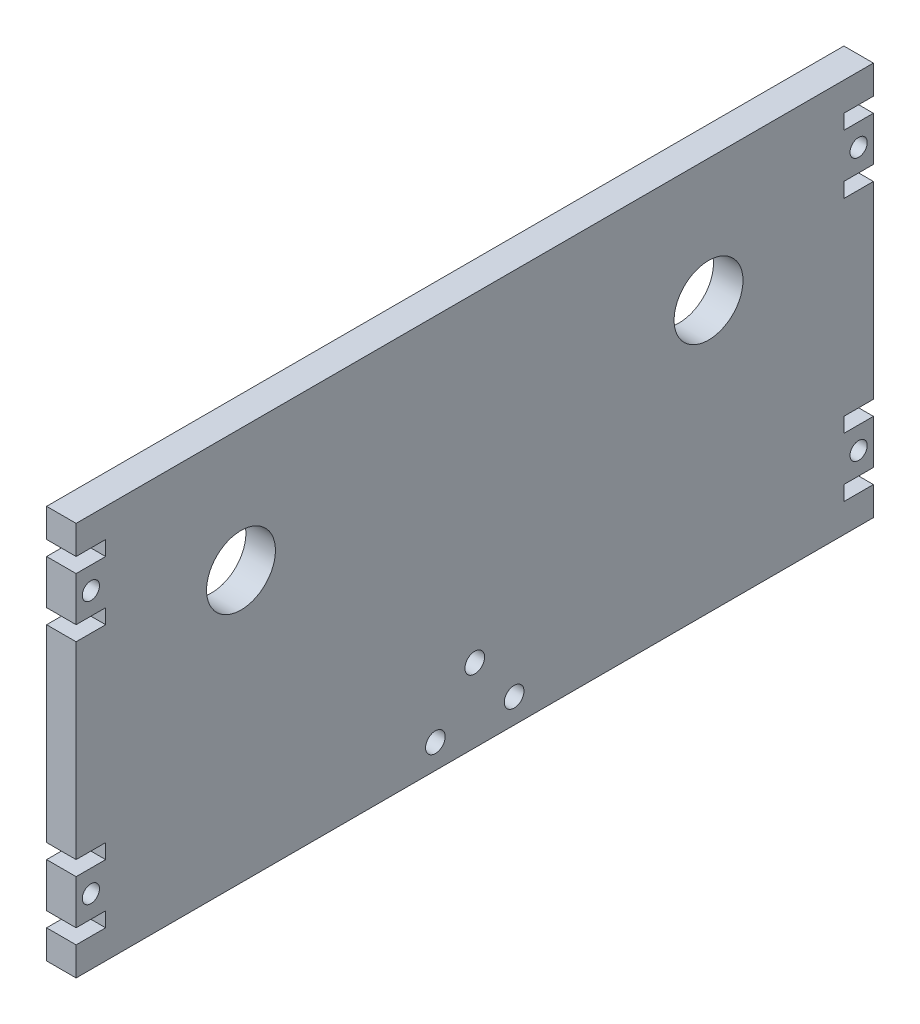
ISO-10303-21;
HEADER;
FILE_DESCRIPTION(('STEP AP214'),'2;1');
FILE_NAME('part.step','',(''),(''),'','','');
FILE_SCHEMA(('AUTOMOTIVE_DESIGN { 1 0 10303 214 1 1 1 1 }'));
ENDSEC;
DATA;
#1=APPLICATION_CONTEXT('core data for automotive mechanical design processes');
#2=APPLICATION_PROTOCOL_DEFINITION('international standard','automotive_design',2000,#1);
#3=PRODUCT_CONTEXT('',#1,'mechanical');
#4=PRODUCT('Part','Part','',(#3));
#5=PRODUCT_RELATED_PRODUCT_CATEGORY('part','',(#4));
#6=PRODUCT_DEFINITION_FORMATION('','',#4);
#7=PRODUCT_DEFINITION_CONTEXT('part definition',#1,'design');
#8=PRODUCT_DEFINITION('design','',#6,#7);
#9=PRODUCT_DEFINITION_SHAPE('','',#8);
#10=(LENGTH_UNIT() NAMED_UNIT(*) SI_UNIT(.MILLI.,.METRE.));
#11=(NAMED_UNIT(*) PLANE_ANGLE_UNIT() SI_UNIT($,.RADIAN.));
#12=(NAMED_UNIT(*) SI_UNIT($,.STERADIAN.) SOLID_ANGLE_UNIT());
#13=UNCERTAINTY_MEASURE_WITH_UNIT(LENGTH_MEASURE(1.E-05),#10,'distance_accuracy_value','');
#14=(GEOMETRIC_REPRESENTATION_CONTEXT(3) GLOBAL_UNCERTAINTY_ASSIGNED_CONTEXT((#13)) GLOBAL_UNIT_ASSIGNED_CONTEXT((#10,
#11,#12)) REPRESENTATION_CONTEXT('',''));
#15=CARTESIAN_POINT('',(0.,0.,0.));
#16=DIRECTION('',(0.,0.,1.));
#17=DIRECTION('',(1.,0.,0.));
#18=AXIS2_PLACEMENT_3D('',#15,#16,#17);
#19=CARTESIAN_POINT('',(3.,-40.,81.));
#20=DIRECTION('',(0.,0.,-1.));
#21=DIRECTION('',(-1.,0.,0.));
#22=AXIS2_PLACEMENT_3D('',#19,#20,#21);
#23=PLANE('',#22);
#24=DIRECTION('',(0.,-1.,0.));
#25=VECTOR('',#24,1.);
#26=CARTESIAN_POINT('',(-3.,-40.,81.));
#27=LINE('',#26,#25);
#28=CARTESIAN_POINT('',(-3.,-22.1666666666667,81.));
#29=VERTEX_POINT('',#28);
#30=CARTESIAN_POINT('',(-3.,-31.1666666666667,81.));
#31=VERTEX_POINT('',#30);
#32=EDGE_CURVE('E467',#29,#31,#27,.T.);
#33=ORIENTED_EDGE('',*,*,#32,.T.);
#34=DIRECTION('',(1.,0.,0.));
#35=VECTOR('',#34,1.);
#36=CARTESIAN_POINT('',(-3.,-31.1666666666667,81.));
#37=LINE('',#36,#35);
#38=CARTESIAN_POINT('',(3.,-31.1666666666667,81.));
#39=VERTEX_POINT('',#38);
#40=EDGE_CURVE('E506',#31,#39,#37,.T.);
#41=ORIENTED_EDGE('',*,*,#40,.T.);
#42=DIRECTION('',(0.,-1.,0.));
#43=VECTOR('',#42,1.);
#44=CARTESIAN_POINT('',(3.,-40.,81.));
#45=LINE('',#44,#43);
#46=CARTESIAN_POINT('',(3.,-22.1666666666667,81.));
#47=VERTEX_POINT('',#46);
#48=EDGE_CURVE('E652',#47,#39,#45,.T.);
#49=ORIENTED_EDGE('',*,*,#48,.F.);
#50=DIRECTION('',(1.,0.,0.));
#51=VECTOR('',#50,1.);
#52=CARTESIAN_POINT('',(-3.,-22.1666666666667,81.));
#53=LINE('',#52,#51);
#54=EDGE_CURVE('E512',#29,#47,#53,.T.);
#55=ORIENTED_EDGE('',*,*,#54,.F.);
#56=EDGE_LOOP('',(#33,#41,#49,#55));
#57=FACE_BOUND('',#56,.T.);
#58=ADVANCED_FACE('F36',(#57),#23,.F.);
#59=CARTESIAN_POINT('',(-3.,19.1666666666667,81.));
#60=VERTEX_POINT('',#59);
#61=CARTESIAN_POINT('',(-3.,-19.1666666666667,81.));
#62=VERTEX_POINT('',#61);
#63=EDGE_CURVE('E466',#60,#62,#27,.T.);
#64=ORIENTED_EDGE('',*,*,#63,.T.);
#65=DIRECTION('',(1.,0.,0.));
#66=VECTOR('',#65,1.);
#67=CARTESIAN_POINT('',(-3.,-19.1666666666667,81.));
#68=LINE('',#67,#66);
#69=CARTESIAN_POINT('',(3.,-19.1666666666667,81.));
#70=VERTEX_POINT('',#69);
#71=EDGE_CURVE('E483',#62,#70,#68,.T.);
#72=ORIENTED_EDGE('',*,*,#71,.T.);
#73=CARTESIAN_POINT('',(3.,19.1666666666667,81.));
#74=VERTEX_POINT('',#73);
#75=EDGE_CURVE('E651',#74,#70,#45,.T.);
#76=ORIENTED_EDGE('',*,*,#75,.F.);
#77=DIRECTION('',(1.,0.,0.));
#78=VECTOR('',#77,1.);
#79=CARTESIAN_POINT('',(-3.,19.1666666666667,81.));
#80=LINE('',#79,#78);
#81=EDGE_CURVE('E397',#60,#74,#80,.T.);
#82=ORIENTED_EDGE('',*,*,#81,.F.);
#83=EDGE_LOOP('',(#64,#72,#76,#82));
#84=FACE_BOUND('',#83,.T.);
#85=ADVANCED_FACE('F481',(#84),#23,.F.);
#86=CARTESIAN_POINT('',(-3.,31.1666666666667,81.));
#87=VERTEX_POINT('',#86);
#88=CARTESIAN_POINT('',(-3.,22.1666666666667,81.));
#89=VERTEX_POINT('',#88);
#90=EDGE_CURVE('E462',#87,#89,#27,.T.);
#91=ORIENTED_EDGE('',*,*,#90,.T.);
#92=DIRECTION('',(1.,0.,0.));
#93=VECTOR('',#92,1.);
#94=CARTESIAN_POINT('',(-3.,22.1666666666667,81.));
#95=LINE('',#94,#93);
#96=CARTESIAN_POINT('',(3.,22.1666666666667,81.));
#97=VERTEX_POINT('',#96);
#98=EDGE_CURVE('E376',#89,#97,#95,.T.);
#99=ORIENTED_EDGE('',*,*,#98,.T.);
#100=CARTESIAN_POINT('',(3.,31.1666666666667,81.));
#101=VERTEX_POINT('',#100);
#102=EDGE_CURVE('E455',#101,#97,#45,.T.);
#103=ORIENTED_EDGE('',*,*,#102,.F.);
#104=DIRECTION('',(1.,0.,0.));
#105=VECTOR('',#104,1.);
#106=CARTESIAN_POINT('',(-3.,31.1666666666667,81.));
#107=LINE('',#106,#105);
#108=EDGE_CURVE('E371',#87,#101,#107,.T.);
#109=ORIENTED_EDGE('',*,*,#108,.F.);
#110=EDGE_LOOP('',(#91,#99,#103,#109));
#111=FACE_BOUND('',#110,.T.);
#112=ADVANCED_FACE('F614',(#111),#23,.F.);
#113=CARTESIAN_POINT('',(-3.,40.,81.));
#114=VERTEX_POINT('',#113);
#115=CARTESIAN_POINT('',(-3.,34.1666666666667,81.));
#116=VERTEX_POINT('',#115);
#117=EDGE_CURVE('E460',#114,#116,#27,.T.);
#118=ORIENTED_EDGE('',*,*,#117,.T.);
#119=DIRECTION('',(1.,0.,0.));
#120=VECTOR('',#119,1.);
#121=CARTESIAN_POINT('',(-3.,34.1666666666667,81.));
#122=LINE('',#121,#120);
#123=CARTESIAN_POINT('',(3.,34.1666666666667,81.));
#124=VERTEX_POINT('',#123);
#125=EDGE_CURVE('E351',#116,#124,#122,.T.);
#126=ORIENTED_EDGE('',*,*,#125,.T.);
#127=CARTESIAN_POINT('',(3.,40.,81.));
#128=VERTEX_POINT('',#127);
#129=EDGE_CURVE('E451',#128,#124,#45,.T.);
#130=ORIENTED_EDGE('',*,*,#129,.F.);
#131=DIRECTION('',(-1.,0.,0.));
#132=VECTOR('',#131,1.);
#133=CARTESIAN_POINT('',(3.,40.,81.));
#134=LINE('',#133,#132);
#135=EDGE_CURVE('E310',#128,#114,#134,.T.);
#136=ORIENTED_EDGE('',*,*,#135,.T.);
#137=EDGE_LOOP('',(#118,#126,#130,#136));
#138=FACE_BOUND('',#137,.T.);
#139=ADVANCED_FACE('F618',(#138),#23,.F.);
#140=CARTESIAN_POINT('',(3.,-40.,-81.));
#141=DIRECTION('',(0.,0.,1.));
#142=DIRECTION('',(1.,0.,0.));
#143=AXIS2_PLACEMENT_3D('',#140,#141,#142);
#144=PLANE('',#143);
#145=DIRECTION('',(0.,1.,0.));
#146=VECTOR('',#145,1.);
#147=CARTESIAN_POINT('',(-3.,-40.,-81.));
#148=LINE('',#147,#146);
#149=CARTESIAN_POINT('',(-3.,-31.1666666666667,-81.));
#150=VERTEX_POINT('',#149);
#151=CARTESIAN_POINT('',(-3.,-22.1666666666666,-81.));
#152=VERTEX_POINT('',#151);
#153=EDGE_CURVE('E295',#150,#152,#148,.T.);
#154=ORIENTED_EDGE('',*,*,#153,.T.);
#155=DIRECTION('',(1.,0.,0.));
#156=VECTOR('',#155,1.);
#157=CARTESIAN_POINT('',(-3.,-22.1666666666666,-81.));
#158=LINE('',#157,#156);
#159=CARTESIAN_POINT('',(3.,-22.1666666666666,-81.));
#160=VERTEX_POINT('',#159);
#161=EDGE_CURVE('E543',#152,#160,#158,.T.);
#162=ORIENTED_EDGE('',*,*,#161,.T.);
#163=DIRECTION('',(0.,1.,0.));
#164=VECTOR('',#163,1.);
#165=CARTESIAN_POINT('',(3.,-40.,-81.));
#166=LINE('',#165,#164);
#167=CARTESIAN_POINT('',(3.,-31.1666666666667,-81.));
#168=VERTEX_POINT('',#167);
#169=EDGE_CURVE('E459',#168,#160,#166,.T.);
#170=ORIENTED_EDGE('',*,*,#169,.F.);
#171=DIRECTION('',(1.,0.,0.));
#172=VECTOR('',#171,1.);
#173=CARTESIAN_POINT('',(-3.,-31.1666666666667,-81.));
#174=LINE('',#173,#172);
#175=EDGE_CURVE('E358',#150,#168,#174,.T.);
#176=ORIENTED_EDGE('',*,*,#175,.F.);
#177=EDGE_LOOP('',(#154,#162,#170,#176));
#178=FACE_BOUND('',#177,.T.);
#179=ADVANCED_FACE('F628',(#178),#144,.F.);
#180=CARTESIAN_POINT('',(-3.,-40.,-81.));
#181=VERTEX_POINT('',#180);
#182=CARTESIAN_POINT('',(-3.,-34.1666666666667,-81.));
#183=VERTEX_POINT('',#182);
#184=EDGE_CURVE('E299',#181,#183,#148,.T.);
#185=ORIENTED_EDGE('',*,*,#184,.T.);
#186=DIRECTION('',(1.,0.,0.));
#187=VECTOR('',#186,1.);
#188=CARTESIAN_POINT('',(-3.,-34.1666666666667,-81.));
#189=LINE('',#188,#187);
#190=CARTESIAN_POINT('',(3.,-34.1666666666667,-81.));
#191=VERTEX_POINT('',#190);
#192=EDGE_CURVE('E348',#183,#191,#189,.T.);
#193=ORIENTED_EDGE('',*,*,#192,.T.);
#194=CARTESIAN_POINT('',(3.,-40.,-81.));
#195=VERTEX_POINT('',#194);
#196=EDGE_CURVE('E324',#195,#191,#166,.T.);
#197=ORIENTED_EDGE('',*,*,#196,.F.);
#198=DIRECTION('',(-1.,0.,0.));
#199=VECTOR('',#198,1.);
#200=CARTESIAN_POINT('',(3.,-40.,-81.));
#201=LINE('',#200,#199);
#202=EDGE_CURVE('E44',#195,#181,#201,.T.);
#203=ORIENTED_EDGE('',*,*,#202,.T.);
#204=EDGE_LOOP('',(#185,#193,#197,#203));
#205=FACE_BOUND('',#204,.T.);
#206=ADVANCED_FACE('F321',(#205),#144,.F.);
#207=CARTESIAN_POINT('',(3.,-19.1666666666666,-81.));
#208=VERTEX_POINT('',#207);
#209=CARTESIAN_POINT('',(3.,19.1666666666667,-81.));
#210=VERTEX_POINT('',#209);
#211=EDGE_CURVE('E1066',#208,#210,#166,.T.);
#212=ORIENTED_EDGE('',*,*,#211,.F.);
#213=DIRECTION('',(1.,0.,0.));
#214=VECTOR('',#213,1.);
#215=CARTESIAN_POINT('',(-3.,-19.1666666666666,-81.));
#216=LINE('',#215,#214);
#217=CARTESIAN_POINT('',(-3.,-19.1666666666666,-81.));
#218=VERTEX_POINT('',#217);
#219=EDGE_CURVE('E294',#218,#208,#216,.T.);
#220=ORIENTED_EDGE('',*,*,#219,.F.);
#221=CARTESIAN_POINT('',(-3.,19.1666666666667,-81.));
#222=VERTEX_POINT('',#221);
#223=EDGE_CURVE('E287',#218,#222,#148,.T.);
#224=ORIENTED_EDGE('',*,*,#223,.T.);
#225=DIRECTION('',(1.,0.,0.));
#226=VECTOR('',#225,1.);
#227=CARTESIAN_POINT('',(-3.,19.1666666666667,-81.));
#228=LINE('',#227,#226);
#229=EDGE_CURVE('E269',#222,#210,#228,.T.);
#230=ORIENTED_EDGE('',*,*,#229,.T.);
#231=EDGE_LOOP('',(#212,#220,#224,#230));
#232=FACE_BOUND('',#231,.T.);
#233=ADVANCED_FACE('F293',(#232),#144,.F.);
#234=CARTESIAN_POINT('',(3.,22.1666666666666,-81.));
#235=VERTEX_POINT('',#234);
#236=CARTESIAN_POINT('',(3.,31.1666666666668,-81.));
#237=VERTEX_POINT('',#236);
#238=EDGE_CURVE('E1064',#235,#237,#166,.T.);
#239=ORIENTED_EDGE('',*,*,#238,.F.);
#240=DIRECTION('',(1.,0.,0.));
#241=VECTOR('',#240,1.);
#242=CARTESIAN_POINT('',(-3.,22.1666666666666,-81.));
#243=LINE('',#242,#241);
#244=CARTESIAN_POINT('',(-3.,22.1666666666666,-81.));
#245=VERTEX_POINT('',#244);
#246=EDGE_CURVE('E280',#245,#235,#243,.T.);
#247=ORIENTED_EDGE('',*,*,#246,.F.);
#248=CARTESIAN_POINT('',(-3.,31.1666666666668,-81.));
#249=VERTEX_POINT('',#248);
#250=EDGE_CURVE('E296',#245,#249,#148,.T.);
#251=ORIENTED_EDGE('',*,*,#250,.T.);
#252=DIRECTION('',(1.,0.,0.));
#253=VECTOR('',#252,1.);
#254=CARTESIAN_POINT('',(-3.,31.1666666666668,-81.));
#255=LINE('',#254,#253);
#256=EDGE_CURVE('E1099',#249,#237,#255,.T.);
#257=ORIENTED_EDGE('',*,*,#256,.T.);
#258=EDGE_LOOP('',(#239,#247,#251,#257));
#259=FACE_BOUND('',#258,.T.);
#260=ADVANCED_FACE('F617',(#259),#144,.F.);
#261=CARTESIAN_POINT('',(3.,-34.1666666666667,81.));
#262=VERTEX_POINT('',#261);
#263=CARTESIAN_POINT('',(3.,-40.,81.));
#264=VERTEX_POINT('',#263);
#265=EDGE_CURVE('E309',#262,#264,#45,.T.);
#266=ORIENTED_EDGE('',*,*,#265,.F.);
#267=DIRECTION('',(1.,0.,0.));
#268=VECTOR('',#267,1.);
#269=CARTESIAN_POINT('',(-3.,-34.1666666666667,81.));
#270=LINE('',#269,#268);
#271=CARTESIAN_POINT('',(-3.,-34.1666666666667,81.));
#272=VERTEX_POINT('',#271);
#273=EDGE_CURVE('E523',#272,#262,#270,.T.);
#274=ORIENTED_EDGE('',*,*,#273,.F.);
#275=CARTESIAN_POINT('',(-3.,-40.,81.));
#276=VERTEX_POINT('',#275);
#277=EDGE_CURVE('E442',#272,#276,#27,.T.);
#278=ORIENTED_EDGE('',*,*,#277,.T.);
#279=DIRECTION('',(-1.,0.,0.));
#280=VECTOR('',#279,1.);
#281=CARTESIAN_POINT('',(3.,-40.,81.));
#282=LINE('',#281,#280);
#283=EDGE_CURVE('E11',#264,#276,#282,.T.);
#284=ORIENTED_EDGE('',*,*,#283,.F.);
#285=EDGE_LOOP('',(#266,#274,#278,#284));
#286=FACE_BOUND('',#285,.T.);
#287=ADVANCED_FACE('F38',(#286),#23,.F.);
#288=CARTESIAN_POINT('',(3.,-40.,-81.));
#289=DIRECTION('',(0.,1.,0.));
#290=DIRECTION('',(0.,0.,1.));
#291=AXIS2_PLACEMENT_3D('',#288,#289,#290);
#292=PLANE('',#291);
#293=DIRECTION('',(0.,0.,-1.));
#294=VECTOR('',#293,1.);
#295=CARTESIAN_POINT('',(-3.,-40.,-81.));
#296=LINE('',#295,#294);
#297=EDGE_CURVE('E306',#276,#181,#296,.T.);
#298=ORIENTED_EDGE('',*,*,#297,.T.);
#299=ORIENTED_EDGE('',*,*,#202,.F.);
#300=DIRECTION('',(0.,0.,-1.));
#301=VECTOR('',#300,1.);
#302=CARTESIAN_POINT('',(3.,-40.,-81.));
#303=LINE('',#302,#301);
#304=EDGE_CURVE('E454',#264,#195,#303,.T.);
#305=ORIENTED_EDGE('',*,*,#304,.F.);
#306=ORIENTED_EDGE('',*,*,#283,.T.);
#307=EDGE_LOOP('',(#298,#299,#305,#306));
#308=FACE_BOUND('',#307,.T.);
#309=ADVANCED_FACE('F616',(#308),#292,.F.);
#310=CARTESIAN_POINT('',(3.,34.1666666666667,-81.));
#311=VERTEX_POINT('',#310);
#312=CARTESIAN_POINT('',(3.,40.,-81.));
#313=VERTEX_POINT('',#312);
#314=EDGE_CURVE('E457',#311,#313,#166,.T.);
#315=ORIENTED_EDGE('',*,*,#314,.F.);
#316=DIRECTION('',(1.,0.,0.));
#317=VECTOR('',#316,1.);
#318=CARTESIAN_POINT('',(-3.,34.1666666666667,-81.));
#319=LINE('',#318,#317);
#320=CARTESIAN_POINT('',(-3.,34.1666666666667,-81.));
#321=VERTEX_POINT('',#320);
#322=EDGE_CURVE('E500',#321,#311,#319,.T.);
#323=ORIENTED_EDGE('',*,*,#322,.F.);
#324=CARTESIAN_POINT('',(-3.,40.,-81.));
#325=VERTEX_POINT('',#324);
#326=EDGE_CURVE('E301',#321,#325,#148,.T.);
#327=ORIENTED_EDGE('',*,*,#326,.T.);
#328=DIRECTION('',(-1.,0.,0.));
#329=VECTOR('',#328,1.);
#330=CARTESIAN_POINT('',(3.,40.,-81.));
#331=LINE('',#330,#329);
#332=EDGE_CURVE('E313',#313,#325,#331,.T.);
#333=ORIENTED_EDGE('',*,*,#332,.F.);
#334=EDGE_LOOP('',(#315,#323,#327,#333));
#335=FACE_BOUND('',#334,.T.);
#336=ADVANCED_FACE('F623',(#335),#144,.F.);
#337=CARTESIAN_POINT('',(3.,40.,-81.));
#338=DIRECTION('',(0.,-1.,0.));
#339=DIRECTION('',(0.,0.,-1.));
#340=AXIS2_PLACEMENT_3D('',#337,#338,#339);
#341=PLANE('',#340);
#342=DIRECTION('',(0.,0.,1.));
#343=VECTOR('',#342,1.);
#344=CARTESIAN_POINT('',(-3.,40.,-81.));
#345=LINE('',#344,#343);
#346=EDGE_CURVE('E305',#325,#114,#345,.T.);
#347=ORIENTED_EDGE('',*,*,#346,.T.);
#348=ORIENTED_EDGE('',*,*,#135,.F.);
#349=DIRECTION('',(0.,0.,1.));
#350=VECTOR('',#349,1.);
#351=CARTESIAN_POINT('',(3.,40.,-81.));
#352=LINE('',#351,#350);
#353=EDGE_CURVE('E314',#313,#128,#352,.T.);
#354=ORIENTED_EDGE('',*,*,#353,.F.);
#355=ORIENTED_EDGE('',*,*,#332,.T.);
#356=EDGE_LOOP('',(#347,#348,#354,#355));
#357=FACE_BOUND('',#356,.T.);
#358=ADVANCED_FACE('F576',(#357),#341,.F.);
#359=CARTESIAN_POINT('',(3.,0.,0.));
#360=DIRECTION('',(1.,0.,0.));
#361=DIRECTION('',(0.,0.,-1.));
#362=AXIS2_PLACEMENT_3D('',#359,#360,#361);
#363=PLANE('',#362);
#364=DIRECTION('',(0.,0.,-1.));
#365=VECTOR('',#364,1.);
#366=CARTESIAN_POINT('',(3.,-22.1666666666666,-81.));
#367=LINE('',#366,#365);
#368=CARTESIAN_POINT('',(3.,-22.1666666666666,-75.));
#369=VERTEX_POINT('',#368);
#370=EDGE_CURVE('E546',#369,#160,#367,.T.);
#371=ORIENTED_EDGE('',*,*,#370,.F.);
#372=DIRECTION('',(0.,-1.,0.));
#373=VECTOR('',#372,1.);
#374=CARTESIAN_POINT('',(3.,-19.1666666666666,-75.));
#375=LINE('',#374,#373);
#376=CARTESIAN_POINT('',(3.,-19.1666666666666,-75.));
#377=VERTEX_POINT('',#376);
#378=EDGE_CURVE('E554',#377,#369,#375,.T.);
#379=ORIENTED_EDGE('',*,*,#378,.F.);
#380=DIRECTION('',(0.,0.,1.));
#381=VECTOR('',#380,1.);
#382=CARTESIAN_POINT('',(3.,-19.1666666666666,-81.));
#383=LINE('',#382,#381);
#384=EDGE_CURVE('E551',#208,#377,#383,.T.);
#385=ORIENTED_EDGE('',*,*,#384,.F.);
#386=ORIENTED_EDGE('',*,*,#211,.T.);
#387=DIRECTION('',(0.,0.,-1.));
#388=VECTOR('',#387,1.);
#389=CARTESIAN_POINT('',(3.,19.1666666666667,-81.));
#390=LINE('',#389,#388);
#391=CARTESIAN_POINT('',(3.,19.1666666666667,-75.));
#392=VERTEX_POINT('',#391);
#393=EDGE_CURVE('E275',#392,#210,#390,.T.);
#394=ORIENTED_EDGE('',*,*,#393,.F.);
#395=DIRECTION('',(0.,-1.,0.));
#396=VECTOR('',#395,1.);
#397=CARTESIAN_POINT('',(3.,19.1666666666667,-75.));
#398=LINE('',#397,#396);
#399=CARTESIAN_POINT('',(3.,22.1666666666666,-75.));
#400=VERTEX_POINT('',#399);
#401=EDGE_CURVE('E290',#400,#392,#398,.T.);
#402=ORIENTED_EDGE('',*,*,#401,.F.);
#403=DIRECTION('',(0.,0.,1.));
#404=VECTOR('',#403,1.);
#405=CARTESIAN_POINT('',(3.,22.1666666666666,-81.));
#406=LINE('',#405,#404);
#407=EDGE_CURVE('E1083',#235,#400,#406,.T.);
#408=ORIENTED_EDGE('',*,*,#407,.F.);
#409=ORIENTED_EDGE('',*,*,#238,.T.);
#410=DIRECTION('',(0.,0.,-1.));
#411=VECTOR('',#410,1.);
#412=CARTESIAN_POINT('',(3.,31.1666666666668,-81.));
#413=LINE('',#412,#411);
#414=CARTESIAN_POINT('',(3.,31.1666666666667,-75.));
#415=VERTEX_POINT('',#414);
#416=EDGE_CURVE('E1104',#415,#237,#413,.T.);
#417=ORIENTED_EDGE('',*,*,#416,.F.);
#418=DIRECTION('',(0.,-1.,0.));
#419=VECTOR('',#418,1.);
#420=CARTESIAN_POINT('',(3.,34.1666666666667,-75.));
#421=LINE('',#420,#419);
#422=CARTESIAN_POINT('',(3.,34.1666666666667,-75.));
#423=VERTEX_POINT('',#422);
#424=EDGE_CURVE('E1113',#423,#415,#421,.T.);
#425=ORIENTED_EDGE('',*,*,#424,.F.);
#426=DIRECTION('',(0.,0.,1.));
#427=VECTOR('',#426,1.);
#428=CARTESIAN_POINT('',(3.,34.1666666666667,-81.));
#429=LINE('',#428,#427);
#430=EDGE_CURVE('E1110',#311,#423,#429,.T.);
#431=ORIENTED_EDGE('',*,*,#430,.F.);
#432=ORIENTED_EDGE('',*,*,#314,.T.);
#433=ORIENTED_EDGE('',*,*,#353,.T.);
#434=ORIENTED_EDGE('',*,*,#129,.T.);
#435=DIRECTION('',(0.,0.,1.));
#436=VECTOR('',#435,1.);
#437=CARTESIAN_POINT('',(3.,34.1666666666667,81.));
#438=LINE('',#437,#436);
#439=CARTESIAN_POINT('',(3.,34.1666666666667,75.));
#440=VERTEX_POINT('',#439);
#441=EDGE_CURVE('E365',#440,#124,#438,.T.);
#442=ORIENTED_EDGE('',*,*,#441,.F.);
#443=DIRECTION('',(0.,1.,0.));
#444=VECTOR('',#443,1.);
#445=CARTESIAN_POINT('',(3.,34.1666666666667,75.));
#446=LINE('',#445,#444);
#447=CARTESIAN_POINT('',(3.,31.1666666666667,75.));
#448=VERTEX_POINT('',#447);
#449=EDGE_CURVE('E375',#448,#440,#446,.T.);
#450=ORIENTED_EDGE('',*,*,#449,.F.);
#451=DIRECTION('',(0.,0.,-1.));
#452=VECTOR('',#451,1.);
#453=CARTESIAN_POINT('',(3.,31.1666666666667,81.));
#454=LINE('',#453,#452);
#455=EDGE_CURVE('E372',#101,#448,#454,.T.);
#456=ORIENTED_EDGE('',*,*,#455,.F.);
#457=ORIENTED_EDGE('',*,*,#102,.T.);
#458=DIRECTION('',(0.,0.,1.));
#459=VECTOR('',#458,1.);
#460=CARTESIAN_POINT('',(3.,22.1666666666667,81.));
#461=LINE('',#460,#459);
#462=CARTESIAN_POINT('',(3.,22.1666666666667,75.));
#463=VERTEX_POINT('',#462);
#464=EDGE_CURVE('E391',#463,#97,#461,.T.);
#465=ORIENTED_EDGE('',*,*,#464,.F.);
#466=DIRECTION('',(0.,1.,0.));
#467=VECTOR('',#466,1.);
#468=CARTESIAN_POINT('',(3.,19.1666666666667,75.));
#469=LINE('',#468,#467);
#470=CARTESIAN_POINT('',(3.,19.1666666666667,75.));
#471=VERTEX_POINT('',#470);
#472=EDGE_CURVE('E401',#471,#463,#469,.T.);
#473=ORIENTED_EDGE('',*,*,#472,.F.);
#474=DIRECTION('',(0.,0.,-1.));
#475=VECTOR('',#474,1.);
#476=CARTESIAN_POINT('',(3.,19.1666666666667,81.));
#477=LINE('',#476,#475);
#478=EDGE_CURVE('E398',#74,#471,#477,.T.);
#479=ORIENTED_EDGE('',*,*,#478,.F.);
#480=ORIENTED_EDGE('',*,*,#75,.T.);
#481=DIRECTION('',(0.,0.,1.));
#482=VECTOR('',#481,1.);
#483=CARTESIAN_POINT('',(3.,-19.1666666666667,81.));
#484=LINE('',#483,#482);
#485=CARTESIAN_POINT('',(3.,-19.1666666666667,75.));
#486=VERTEX_POINT('',#485);
#487=EDGE_CURVE('E504',#486,#70,#484,.T.);
#488=ORIENTED_EDGE('',*,*,#487,.F.);
#489=DIRECTION('',(0.,1.,0.));
#490=VECTOR('',#489,1.);
#491=CARTESIAN_POINT('',(3.,-19.1666666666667,75.));
#492=LINE('',#491,#490);
#493=CARTESIAN_POINT('',(3.,-22.1666666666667,75.));
#494=VERTEX_POINT('',#493);
#495=EDGE_CURVE('E493',#494,#486,#492,.T.);
#496=ORIENTED_EDGE('',*,*,#495,.F.);
#497=DIRECTION('',(0.,0.,-1.));
#498=VECTOR('',#497,1.);
#499=CARTESIAN_POINT('',(3.,-22.1666666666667,81.));
#500=LINE('',#499,#498);
#501=EDGE_CURVE('E497',#47,#494,#500,.T.);
#502=ORIENTED_EDGE('',*,*,#501,.F.);
#503=ORIENTED_EDGE('',*,*,#48,.T.);
#504=DIRECTION('',(0.,0.,1.));
#505=VECTOR('',#504,1.);
#506=CARTESIAN_POINT('',(3.,-31.1666666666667,81.));
#507=LINE('',#506,#505);
#508=CARTESIAN_POINT('',(3.,-31.1666666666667,75.));
#509=VERTEX_POINT('',#508);
#510=EDGE_CURVE('E518',#509,#39,#507,.T.);
#511=ORIENTED_EDGE('',*,*,#510,.F.);
#512=DIRECTION('',(0.,1.,0.));
#513=VECTOR('',#512,1.);
#514=CARTESIAN_POINT('',(3.,-34.1666666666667,75.));
#515=LINE('',#514,#513);
#516=CARTESIAN_POINT('',(3.,-34.1666666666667,75.));
#517=VERTEX_POINT('',#516);
#518=EDGE_CURVE('E527',#517,#509,#515,.T.);
#519=ORIENTED_EDGE('',*,*,#518,.F.);
#520=DIRECTION('',(0.,0.,-1.));
#521=VECTOR('',#520,1.);
#522=CARTESIAN_POINT('',(3.,-34.1666666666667,81.));
#523=LINE('',#522,#521);
#524=EDGE_CURVE('E524',#262,#517,#523,.T.);
#525=ORIENTED_EDGE('',*,*,#524,.F.);
#526=ORIENTED_EDGE('',*,*,#265,.T.);
#527=ORIENTED_EDGE('',*,*,#304,.T.);
#528=ORIENTED_EDGE('',*,*,#196,.T.);
#529=DIRECTION('',(0.,0.,-1.));
#530=VECTOR('',#529,1.);
#531=CARTESIAN_POINT('',(3.,-34.1666666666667,-81.));
#532=LINE('',#531,#530);
#533=CARTESIAN_POINT('',(3.,-34.1666666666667,-75.0000000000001));
#534=VERTEX_POINT('',#533);
#535=EDGE_CURVE('E349',#534,#191,#532,.T.);
#536=ORIENTED_EDGE('',*,*,#535,.F.);
#537=DIRECTION('',(0.,-1.,0.));
#538=VECTOR('',#537,1.);
#539=CARTESIAN_POINT('',(3.,-34.1666666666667,-75.0000000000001));
#540=LINE('',#539,#538);
#541=CARTESIAN_POINT('',(3.,-31.1666666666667,-75.0000000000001));
#542=VERTEX_POINT('',#541);
#543=EDGE_CURVE('E337',#542,#534,#540,.T.);
#544=ORIENTED_EDGE('',*,*,#543,.F.);
#545=DIRECTION('',(0.,0.,1.));
#546=VECTOR('',#545,1.);
#547=CARTESIAN_POINT('',(3.,-31.1666666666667,-81.));
#548=LINE('',#547,#546);
#549=EDGE_CURVE('E341',#168,#542,#548,.T.);
#550=ORIENTED_EDGE('',*,*,#549,.F.);
#551=ORIENTED_EDGE('',*,*,#169,.T.);
#552=EDGE_LOOP('',(#371,#379,#385,#386,#394,#402,#408,#409,#417,#425,#431,#432,#433,#434,#442,
#450,#456,#457,#465,#473,#479,#480,#488,#496,#502,#503,#511,#519,#525,#526,#527,#528,#536,#544,
#550,#551));
#553=FACE_BOUND('',#552,.T.);
#554=CARTESIAN_POINT('',(3.,-26.6666666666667,-78.));
#555=DIRECTION('',(1.,0.,0.));
#556=DIRECTION('',(0.,0.,1.));
#557=AXIS2_PLACEMENT_3D('',#554,#555,#556);
#558=CIRCLE('',#557,1.75);
#559=CARTESIAN_POINT('',(3.,-26.6666666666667,-76.25));
#560=VERTEX_POINT('',#559);
#561=EDGE_CURVE('E540',#560,#560,#558,.T.);
#562=ORIENTED_EDGE('',*,*,#561,.F.);
#563=EDGE_LOOP('',(#562));
#564=FACE_BOUND('',#563,.T.);
#565=CARTESIAN_POINT('',(3.,-26.6666666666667,78.));
#566=DIRECTION('',(1.,0.,0.));
#567=DIRECTION('',(0.,0.,-1.));
#568=AXIS2_PLACEMENT_3D('',#565,#566,#567);
#569=CIRCLE('',#568,1.75);
#570=CARTESIAN_POINT('',(3.,-26.6666666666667,76.25));
#571=VERTEX_POINT('',#570);
#572=EDGE_CURVE('E344',#571,#571,#569,.T.);
#573=ORIENTED_EDGE('',*,*,#572,.F.);
#574=EDGE_LOOP('',(#573));
#575=FACE_BOUND('',#574,.T.);
#576=CARTESIAN_POINT('',(3.,26.6666666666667,-78.));
#577=DIRECTION('',(1.,0.,0.));
#578=DIRECTION('',(0.,0.,1.));
#579=AXIS2_PLACEMENT_3D('',#576,#577,#578);
#580=CIRCLE('',#579,1.75);
#581=CARTESIAN_POINT('',(3.,26.6666666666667,-76.25));
#582=VERTEX_POINT('',#581);
#583=EDGE_CURVE('E582',#582,#582,#580,.T.);
#584=ORIENTED_EDGE('',*,*,#583,.F.);
#585=EDGE_LOOP('',(#584));
#586=FACE_BOUND('',#585,.T.);
#587=CARTESIAN_POINT('',(3.,26.6666666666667,78.));
#588=DIRECTION('',(1.,0.,0.));
#589=DIRECTION('',(0.,0.,-1.));
#590=AXIS2_PLACEMENT_3D('',#587,#588,#589);
#591=CIRCLE('',#590,1.75);
#592=CARTESIAN_POINT('',(3.,26.6666666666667,76.25));
#593=VERTEX_POINT('',#592);
#594=EDGE_CURVE('E417',#593,#593,#591,.T.);
#595=ORIENTED_EDGE('',*,*,#594,.F.);
#596=EDGE_LOOP('',(#595));
#597=FACE_BOUND('',#596,.T.);
#598=CARTESIAN_POINT('',(3.,-35.,8.));
#599=DIRECTION('',(1.,0.,0.));
#600=DIRECTION('',(0.,0.,-1.));
#601=AXIS2_PLACEMENT_3D('',#598,#599,#600);
#602=CIRCLE('',#601,2.);
#603=CARTESIAN_POINT('',(3.,-35.,6.));
#604=VERTEX_POINT('',#603);
#605=EDGE_CURVE('E425',#604,#604,#602,.T.);
#606=ORIENTED_EDGE('',*,*,#605,.F.);
#607=EDGE_LOOP('',(#606));
#608=FACE_BOUND('',#607,.T.);
#609=CARTESIAN_POINT('',(3.,-35.,-8.));
#610=DIRECTION('',(1.,0.,0.));
#611=DIRECTION('',(0.,0.,-1.));
#612=AXIS2_PLACEMENT_3D('',#609,#610,#611);
#613=CIRCLE('',#612,2.);
#614=CARTESIAN_POINT('',(3.,-35.,-10.));
#615=VERTEX_POINT('',#614);
#616=EDGE_CURVE('E431',#615,#615,#613,.T.);
#617=ORIENTED_EDGE('',*,*,#616,.F.);
#618=EDGE_LOOP('',(#617));
#619=FACE_BOUND('',#618,.T.);
#620=CARTESIAN_POINT('',(3.,-25.,0.));
#621=DIRECTION('',(1.,0.,0.));
#622=DIRECTION('',(0.,0.,-1.));
#623=AXIS2_PLACEMENT_3D('',#620,#621,#622);
#624=CIRCLE('',#623,2.);
#625=CARTESIAN_POINT('',(3.,-25.,-2.));
#626=VERTEX_POINT('',#625);
#627=EDGE_CURVE('E416',#626,#626,#624,.T.);
#628=ORIENTED_EDGE('',*,*,#627,.F.);
#629=EDGE_LOOP('',(#628));
#630=FACE_BOUND('',#629,.T.);
#631=CARTESIAN_POINT('',(3.,15.,47.5));
#632=DIRECTION('',(1.,0.,0.));
#633=DIRECTION('',(0.,0.,-1.));
#634=AXIS2_PLACEMENT_3D('',#631,#632,#633);
#635=CIRCLE('',#634,7.);
#636=CARTESIAN_POINT('',(3.,15.,40.5));
#637=VERTEX_POINT('',#636);
#638=EDGE_CURVE('E443',#637,#637,#635,.T.);
#639=ORIENTED_EDGE('',*,*,#638,.F.);
#640=EDGE_LOOP('',(#639));
#641=FACE_BOUND('',#640,.T.);
#642=CARTESIAN_POINT('',(3.,15.,-47.5));
#643=DIRECTION('',(1.,0.,0.));
#644=DIRECTION('',(0.,0.,-1.));
#645=AXIS2_PLACEMENT_3D('',#642,#643,#644);
#646=CIRCLE('',#645,6.99999999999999);
#647=CARTESIAN_POINT('',(3.,15.,-54.5));
#648=VERTEX_POINT('',#647);
#649=EDGE_CURVE('E424',#648,#648,#646,.T.);
#650=ORIENTED_EDGE('',*,*,#649,.F.);
#651=EDGE_LOOP('',(#650));
#652=FACE_BOUND('',#651,.T.);
#653=ADVANCED_FACE('F573',(#553,#564,#575,#586,#597,#608,#619,#630,#641,#652),#363,.T.);
#654=CARTESIAN_POINT('',(-3.,0.,0.));
#655=DIRECTION('',(1.,0.,0.));
#656=DIRECTION('',(0.,0.,-1.));
#657=AXIS2_PLACEMENT_3D('',#654,#655,#656);
#658=PLANE('',#657);
#659=CARTESIAN_POINT('',(-3.,-26.6666666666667,-78.));
#660=DIRECTION('',(1.,0.,0.));
#661=DIRECTION('',(0.,0.,1.));
#662=AXIS2_PLACEMENT_3D('',#659,#660,#661);
#663=CIRCLE('',#662,1.75);
#664=CARTESIAN_POINT('',(-3.,-26.6666666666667,-76.25));
#665=VERTEX_POINT('',#664);
#666=EDGE_CURVE('E528',#665,#665,#663,.T.);
#667=ORIENTED_EDGE('',*,*,#666,.T.);
#668=EDGE_LOOP('',(#667));
#669=FACE_BOUND('',#668,.T.);
#670=CARTESIAN_POINT('',(-3.,-26.6666666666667,78.));
#671=DIRECTION('',(1.,0.,0.));
#672=DIRECTION('',(0.,0.,-1.));
#673=AXIS2_PLACEMENT_3D('',#670,#671,#672);
#674=CIRCLE('',#673,1.75);
#675=CARTESIAN_POINT('',(-3.,-26.6666666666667,76.25));
#676=VERTEX_POINT('',#675);
#677=EDGE_CURVE('E420',#676,#676,#674,.T.);
#678=ORIENTED_EDGE('',*,*,#677,.T.);
#679=EDGE_LOOP('',(#678));
#680=FACE_BOUND('',#679,.T.);
#681=CARTESIAN_POINT('',(-3.,26.6666666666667,-78.));
#682=DIRECTION('',(1.,0.,0.));
#683=DIRECTION('',(0.,0.,1.));
#684=AXIS2_PLACEMENT_3D('',#681,#682,#683);
#685=CIRCLE('',#684,1.75);
#686=CARTESIAN_POINT('',(-3.,26.6666666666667,-76.25));
#687=VERTEX_POINT('',#686);
#688=EDGE_CURVE('E1084',#687,#687,#685,.T.);
#689=ORIENTED_EDGE('',*,*,#688,.T.);
#690=EDGE_LOOP('',(#689));
#691=FACE_BOUND('',#690,.T.);
#692=CARTESIAN_POINT('',(-3.,26.6666666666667,78.));
#693=DIRECTION('',(1.,0.,0.));
#694=DIRECTION('',(0.,0.,-1.));
#695=AXIS2_PLACEMENT_3D('',#692,#693,#694);
#696=CIRCLE('',#695,1.75);
#697=CARTESIAN_POINT('',(-3.,26.6666666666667,76.25));
#698=VERTEX_POINT('',#697);
#699=EDGE_CURVE('E413',#698,#698,#696,.T.);
#700=ORIENTED_EDGE('',*,*,#699,.T.);
#701=EDGE_LOOP('',(#700));
#702=FACE_BOUND('',#701,.T.);
#703=CARTESIAN_POINT('',(-3.,-35.,8.));
#704=DIRECTION('',(1.,0.,0.));
#705=DIRECTION('',(0.,0.,-1.));
#706=AXIS2_PLACEMENT_3D('',#703,#704,#705);
#707=CIRCLE('',#706,2.);
#708=CARTESIAN_POINT('',(-3.,-35.,6.));
#709=VERTEX_POINT('',#708);
#710=EDGE_CURVE('E421',#709,#709,#707,.T.);
#711=ORIENTED_EDGE('',*,*,#710,.T.);
#712=EDGE_LOOP('',(#711));
#713=FACE_BOUND('',#712,.T.);
#714=CARTESIAN_POINT('',(-3.,-35.,-8.));
#715=DIRECTION('',(1.,0.,0.));
#716=DIRECTION('',(0.,0.,-1.));
#717=AXIS2_PLACEMENT_3D('',#714,#715,#716);
#718=CIRCLE('',#717,2.);
#719=CARTESIAN_POINT('',(-3.,-35.,-10.));
#720=VERTEX_POINT('',#719);
#721=EDGE_CURVE('E428',#720,#720,#718,.T.);
#722=ORIENTED_EDGE('',*,*,#721,.T.);
#723=EDGE_LOOP('',(#722));
#724=FACE_BOUND('',#723,.T.);
#725=CARTESIAN_POINT('',(-3.,-25.,0.));
#726=DIRECTION('',(1.,0.,0.));
#727=DIRECTION('',(0.,0.,-1.));
#728=AXIS2_PLACEMENT_3D('',#725,#726,#727);
#729=CIRCLE('',#728,2.);
#730=CARTESIAN_POINT('',(-3.,-25.,-2.));
#731=VERTEX_POINT('',#730);
#732=EDGE_CURVE('E434',#731,#731,#729,.T.);
#733=ORIENTED_EDGE('',*,*,#732,.T.);
#734=EDGE_LOOP('',(#733));
#735=FACE_BOUND('',#734,.T.);
#736=CARTESIAN_POINT('',(-3.,15.,47.5));
#737=DIRECTION('',(1.,0.,0.));
#738=DIRECTION('',(0.,0.,-1.));
#739=AXIS2_PLACEMENT_3D('',#736,#737,#738);
#740=CIRCLE('',#739,7.);
#741=CARTESIAN_POINT('',(-3.,15.,40.5));
#742=VERTEX_POINT('',#741);
#743=EDGE_CURVE('E439',#742,#742,#740,.T.);
#744=ORIENTED_EDGE('',*,*,#743,.T.);
#745=EDGE_LOOP('',(#744));
#746=FACE_BOUND('',#745,.T.);
#747=CARTESIAN_POINT('',(-3.,15.,-47.5));
#748=DIRECTION('',(1.,0.,0.));
#749=DIRECTION('',(0.,0.,-1.));
#750=AXIS2_PLACEMENT_3D('',#747,#748,#749);
#751=CIRCLE('',#750,6.99999999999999);
#752=CARTESIAN_POINT('',(-3.,15.,-54.5));
#753=VERTEX_POINT('',#752);
#754=EDGE_CURVE('E446',#753,#753,#751,.T.);
#755=ORIENTED_EDGE('',*,*,#754,.T.);
#756=EDGE_LOOP('',(#755));
#757=FACE_BOUND('',#756,.T.);
#758=DIRECTION('',(0.,-1.,0.));
#759=VECTOR('',#758,1.);
#760=CARTESIAN_POINT('',(-3.,-19.1666666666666,-75.));
#761=LINE('',#760,#759);
#762=CARTESIAN_POINT('',(-3.,-19.1666666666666,-75.));
#763=VERTEX_POINT('',#762);
#764=CARTESIAN_POINT('',(-3.,-22.1666666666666,-75.));
#765=VERTEX_POINT('',#764);
#766=EDGE_CURVE('E51',#763,#765,#761,.T.);
#767=ORIENTED_EDGE('',*,*,#766,.T.);
#768=DIRECTION('',(0.,0.,-1.));
#769=VECTOR('',#768,1.);
#770=CARTESIAN_POINT('',(-3.,-22.1666666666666,-81.));
#771=LINE('',#770,#769);
#772=EDGE_CURVE('E548',#765,#152,#771,.T.);
#773=ORIENTED_EDGE('',*,*,#772,.T.);
#774=ORIENTED_EDGE('',*,*,#153,.F.);
#775=DIRECTION('',(0.,0.,1.));
#776=VECTOR('',#775,1.);
#777=CARTESIAN_POINT('',(-3.,-31.1666666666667,-81.));
#778=LINE('',#777,#776);
#779=CARTESIAN_POINT('',(-3.,-31.1666666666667,-75.0000000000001));
#780=VERTEX_POINT('',#779);
#781=EDGE_CURVE('E336',#150,#780,#778,.T.);
#782=ORIENTED_EDGE('',*,*,#781,.T.);
#783=DIRECTION('',(0.,-1.,0.));
#784=VECTOR('',#783,1.);
#785=CARTESIAN_POINT('',(-3.,-34.1666666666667,-75.0000000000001));
#786=LINE('',#785,#784);
#787=CARTESIAN_POINT('',(-3.,-34.1666666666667,-75.0000000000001));
#788=VERTEX_POINT('',#787);
#789=EDGE_CURVE('E334',#780,#788,#786,.T.);
#790=ORIENTED_EDGE('',*,*,#789,.T.);
#791=DIRECTION('',(0.,0.,-1.));
#792=VECTOR('',#791,1.);
#793=CARTESIAN_POINT('',(-3.,-34.1666666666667,-81.));
#794=LINE('',#793,#792);
#795=EDGE_CURVE('E332',#788,#183,#794,.T.);
#796=ORIENTED_EDGE('',*,*,#795,.T.);
#797=ORIENTED_EDGE('',*,*,#184,.F.);
#798=ORIENTED_EDGE('',*,*,#297,.F.);
#799=ORIENTED_EDGE('',*,*,#277,.F.);
#800=DIRECTION('',(0.,0.,-1.));
#801=VECTOR('',#800,1.);
#802=CARTESIAN_POINT('',(-3.,-34.1666666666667,81.));
#803=LINE('',#802,#801);
#804=CARTESIAN_POINT('',(-3.,-34.1666666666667,75.));
#805=VERTEX_POINT('',#804);
#806=EDGE_CURVE('E515',#272,#805,#803,.T.);
#807=ORIENTED_EDGE('',*,*,#806,.T.);
#808=DIRECTION('',(0.,1.,0.));
#809=VECTOR('',#808,1.);
#810=CARTESIAN_POINT('',(-3.,-34.1666666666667,75.));
#811=LINE('',#810,#809);
#812=CARTESIAN_POINT('',(-3.,-31.1666666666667,75.));
#813=VERTEX_POINT('',#812);
#814=EDGE_CURVE('E59',#805,#813,#811,.T.);
#815=ORIENTED_EDGE('',*,*,#814,.T.);
#816=DIRECTION('',(0.,0.,1.));
#817=VECTOR('',#816,1.);
#818=CARTESIAN_POINT('',(-3.,-31.1666666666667,81.));
#819=LINE('',#818,#817);
#820=EDGE_CURVE('E520',#813,#31,#819,.T.);
#821=ORIENTED_EDGE('',*,*,#820,.T.);
#822=ORIENTED_EDGE('',*,*,#32,.F.);
#823=DIRECTION('',(0.,0.,-1.));
#824=VECTOR('',#823,1.);
#825=CARTESIAN_POINT('',(-3.,-22.1666666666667,81.));
#826=LINE('',#825,#824);
#827=CARTESIAN_POINT('',(-3.,-22.1666666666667,75.));
#828=VERTEX_POINT('',#827);
#829=EDGE_CURVE('E492',#29,#828,#826,.T.);
#830=ORIENTED_EDGE('',*,*,#829,.T.);
#831=DIRECTION('',(0.,1.,0.));
#832=VECTOR('',#831,1.);
#833=CARTESIAN_POINT('',(-3.,-19.1666666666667,75.));
#834=LINE('',#833,#832);
#835=CARTESIAN_POINT('',(-3.,-19.1666666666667,75.));
#836=VERTEX_POINT('',#835);
#837=EDGE_CURVE('E490',#828,#836,#834,.T.);
#838=ORIENTED_EDGE('',*,*,#837,.T.);
#839=DIRECTION('',(0.,0.,1.));
#840=VECTOR('',#839,1.);
#841=CARTESIAN_POINT('',(-3.,-19.1666666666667,81.));
#842=LINE('',#841,#840);
#843=EDGE_CURVE('E488',#836,#62,#842,.T.);
#844=ORIENTED_EDGE('',*,*,#843,.T.);
#845=ORIENTED_EDGE('',*,*,#63,.F.);
#846=DIRECTION('',(0.,0.,-1.));
#847=VECTOR('',#846,1.);
#848=CARTESIAN_POINT('',(-3.,19.1666666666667,81.));
#849=LINE('',#848,#847);
#850=CARTESIAN_POINT('',(-3.,19.1666666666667,75.));
#851=VERTEX_POINT('',#850);
#852=EDGE_CURVE('E387',#60,#851,#849,.T.);
#853=ORIENTED_EDGE('',*,*,#852,.T.);
#854=DIRECTION('',(0.,1.,0.));
#855=VECTOR('',#854,1.);
#856=CARTESIAN_POINT('',(-3.,19.1666666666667,75.));
#857=LINE('',#856,#855);
#858=CARTESIAN_POINT('',(-3.,22.1666666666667,75.));
#859=VERTEX_POINT('',#858);
#860=EDGE_CURVE('E390',#851,#859,#857,.T.);
#861=ORIENTED_EDGE('',*,*,#860,.T.);
#862=DIRECTION('',(0.,0.,1.));
#863=VECTOR('',#862,1.);
#864=CARTESIAN_POINT('',(-3.,22.1666666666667,81.));
#865=LINE('',#864,#863);
#866=EDGE_CURVE('E394',#859,#89,#865,.T.);
#867=ORIENTED_EDGE('',*,*,#866,.T.);
#868=ORIENTED_EDGE('',*,*,#90,.F.);
#869=DIRECTION('',(0.,0.,-1.));
#870=VECTOR('',#869,1.);
#871=CARTESIAN_POINT('',(-3.,31.1666666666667,81.));
#872=LINE('',#871,#870);
#873=CARTESIAN_POINT('',(-3.,31.1666666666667,75.));
#874=VERTEX_POINT('',#873);
#875=EDGE_CURVE('E361',#87,#874,#872,.T.);
#876=ORIENTED_EDGE('',*,*,#875,.T.);
#877=DIRECTION('',(0.,1.,0.));
#878=VECTOR('',#877,1.);
#879=CARTESIAN_POINT('',(-3.,34.1666666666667,75.));
#880=LINE('',#879,#878);
#881=CARTESIAN_POINT('',(-3.,34.1666666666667,75.));
#882=VERTEX_POINT('',#881);
#883=EDGE_CURVE('E364',#874,#882,#880,.T.);
#884=ORIENTED_EDGE('',*,*,#883,.T.);
#885=DIRECTION('',(0.,0.,1.));
#886=VECTOR('',#885,1.);
#887=CARTESIAN_POINT('',(-3.,34.1666666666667,81.));
#888=LINE('',#887,#886);
#889=EDGE_CURVE('E368',#882,#116,#888,.T.);
#890=ORIENTED_EDGE('',*,*,#889,.T.);
#891=ORIENTED_EDGE('',*,*,#117,.F.);
#892=ORIENTED_EDGE('',*,*,#346,.F.);
#893=ORIENTED_EDGE('',*,*,#326,.F.);
#894=DIRECTION('',(0.,0.,1.));
#895=VECTOR('',#894,1.);
#896=CARTESIAN_POINT('',(-3.,34.1666666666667,-81.));
#897=LINE('',#896,#895);
#898=CARTESIAN_POINT('',(-3.,34.1666666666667,-75.));
#899=VERTEX_POINT('',#898);
#900=EDGE_CURVE('E1100',#321,#899,#897,.T.);
#901=ORIENTED_EDGE('',*,*,#900,.T.);
#902=DIRECTION('',(0.,-1.,0.));
#903=VECTOR('',#902,1.);
#904=CARTESIAN_POINT('',(-3.,34.1666666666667,-75.));
#905=LINE('',#904,#903);
#906=CARTESIAN_POINT('',(-3.,31.1666666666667,-75.));
#907=VERTEX_POINT('',#906);
#908=EDGE_CURVE('E1103',#899,#907,#905,.T.);
#909=ORIENTED_EDGE('',*,*,#908,.T.);
#910=DIRECTION('',(0.,0.,-1.));
#911=VECTOR('',#910,1.);
#912=CARTESIAN_POINT('',(-3.,31.1666666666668,-81.));
#913=LINE('',#912,#911);
#914=EDGE_CURVE('E1107',#907,#249,#913,.T.);
#915=ORIENTED_EDGE('',*,*,#914,.T.);
#916=ORIENTED_EDGE('',*,*,#250,.F.);
#917=DIRECTION('',(0.,0.,1.));
#918=VECTOR('',#917,1.);
#919=CARTESIAN_POINT('',(-3.,22.1666666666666,-81.));
#920=LINE('',#919,#918);
#921=CARTESIAN_POINT('',(-3.,22.1666666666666,-75.));
#922=VERTEX_POINT('',#921);
#923=EDGE_CURVE('E289',#245,#922,#920,.T.);
#924=ORIENTED_EDGE('',*,*,#923,.T.);
#925=DIRECTION('',(0.,-1.,0.));
#926=VECTOR('',#925,1.);
#927=CARTESIAN_POINT('',(-3.,19.1666666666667,-75.));
#928=LINE('',#927,#926);
#929=CARTESIAN_POINT('',(-3.,19.1666666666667,-75.));
#930=VERTEX_POINT('',#929);
#931=EDGE_CURVE('E281',#922,#930,#928,.T.);
#932=ORIENTED_EDGE('',*,*,#931,.T.);
#933=DIRECTION('',(0.,0.,-1.));
#934=VECTOR('',#933,1.);
#935=CARTESIAN_POINT('',(-3.,19.1666666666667,-81.));
#936=LINE('',#935,#934);
#937=EDGE_CURVE('E272',#930,#222,#936,.T.);
#938=ORIENTED_EDGE('',*,*,#937,.T.);
#939=ORIENTED_EDGE('',*,*,#223,.F.);
#940=DIRECTION('',(0.,0.,1.));
#941=VECTOR('',#940,1.);
#942=CARTESIAN_POINT('',(-3.,-19.1666666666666,-81.));
#943=LINE('',#942,#941);
#944=EDGE_CURVE('E544',#218,#763,#943,.T.);
#945=ORIENTED_EDGE('',*,*,#944,.T.);
#946=EDGE_LOOP('',(#767,#773,#774,#782,#790,#796,#797,#798,#799,#807,#815,#821,#822,#830,#838,
#844,#845,#853,#861,#867,#868,#876,#884,#890,#891,#892,#893,#901,#909,#915,#916,#924,#932,#938,
#939,#945));
#947=FACE_BOUND('',#946,.T.);
#948=ADVANCED_FACE('F285',(#669,#680,#691,#702,#713,#724,#735,#746,#757,#947),#658,.F.);
#949=CARTESIAN_POINT('',(-3.,15.,-47.5));
#950=DIRECTION('',(1.,0.,0.));
#951=DIRECTION('',(0.,0.,-1.));
#952=AXIS2_PLACEMENT_3D('',#949,#950,#951);
#953=CYLINDRICAL_SURFACE('',#952,6.99999999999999);
#954=ORIENTED_EDGE('',*,*,#754,.F.);
#955=EDGE_LOOP('',(#954));
#956=FACE_BOUND('',#955,.T.);
#957=ORIENTED_EDGE('',*,*,#649,.T.);
#958=EDGE_LOOP('',(#957));
#959=FACE_BOUND('',#958,.T.);
#960=ADVANCED_FACE('F595',(#956,#959),#953,.F.);
#961=CARTESIAN_POINT('',(-3.,15.,47.5));
#962=DIRECTION('',(1.,0.,0.));
#963=DIRECTION('',(0.,0.,-1.));
#964=AXIS2_PLACEMENT_3D('',#961,#962,#963);
#965=CYLINDRICAL_SURFACE('',#964,7.);
#966=ORIENTED_EDGE('',*,*,#743,.F.);
#967=EDGE_LOOP('',(#966));
#968=FACE_BOUND('',#967,.T.);
#969=ORIENTED_EDGE('',*,*,#638,.T.);
#970=EDGE_LOOP('',(#969));
#971=FACE_BOUND('',#970,.T.);
#972=ADVANCED_FACE('F597',(#968,#971),#965,.F.);
#973=CARTESIAN_POINT('',(-3.,-25.,0.));
#974=DIRECTION('',(1.,0.,0.));
#975=DIRECTION('',(0.,0.,-1.));
#976=AXIS2_PLACEMENT_3D('',#973,#974,#975);
#977=CYLINDRICAL_SURFACE('',#976,2.);
#978=ORIENTED_EDGE('',*,*,#732,.F.);
#979=EDGE_LOOP('',(#978));
#980=FACE_BOUND('',#979,.T.);
#981=ORIENTED_EDGE('',*,*,#627,.T.);
#982=EDGE_LOOP('',(#981));
#983=FACE_BOUND('',#982,.T.);
#984=ADVANCED_FACE('F604',(#980,#983),#977,.F.);
#985=CARTESIAN_POINT('',(-3.,-35.,-8.));
#986=DIRECTION('',(1.,0.,0.));
#987=DIRECTION('',(0.,0.,-1.));
#988=AXIS2_PLACEMENT_3D('',#985,#986,#987);
#989=CYLINDRICAL_SURFACE('',#988,2.);
#990=ORIENTED_EDGE('',*,*,#721,.F.);
#991=EDGE_LOOP('',(#990));
#992=FACE_BOUND('',#991,.T.);
#993=ORIENTED_EDGE('',*,*,#616,.T.);
#994=EDGE_LOOP('',(#993));
#995=FACE_BOUND('',#994,.T.);
#996=ADVANCED_FACE('F747',(#992,#995),#989,.F.);
#997=CARTESIAN_POINT('',(-3.,-35.,8.));
#998=DIRECTION('',(1.,0.,0.));
#999=DIRECTION('',(0.,0.,-1.));
#1000=AXIS2_PLACEMENT_3D('',#997,#998,#999);
#1001=CYLINDRICAL_SURFACE('',#1000,2.);
#1002=ORIENTED_EDGE('',*,*,#710,.F.);
#1003=EDGE_LOOP('',(#1002));
#1004=FACE_BOUND('',#1003,.T.);
#1005=ORIENTED_EDGE('',*,*,#605,.T.);
#1006=EDGE_LOOP('',(#1005));
#1007=FACE_BOUND('',#1006,.T.);
#1008=ADVANCED_FACE('F743',(#1004,#1007),#1001,.F.);
#1009=CARTESIAN_POINT('',(-3.,26.6666666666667,78.));
#1010=DIRECTION('',(1.,0.,0.));
#1011=DIRECTION('',(0.,0.,-1.));
#1012=AXIS2_PLACEMENT_3D('',#1009,#1010,#1011);
#1013=CYLINDRICAL_SURFACE('',#1012,1.75);
#1014=ORIENTED_EDGE('',*,*,#699,.F.);
#1015=EDGE_LOOP('',(#1014));
#1016=FACE_BOUND('',#1015,.T.);
#1017=ORIENTED_EDGE('',*,*,#594,.T.);
#1018=EDGE_LOOP('',(#1017));
#1019=FACE_BOUND('',#1018,.T.);
#1020=ADVANCED_FACE('F739',(#1016,#1019),#1013,.F.);
#1021=CARTESIAN_POINT('',(-3.,31.1666666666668,-81.));
#1022=DIRECTION('',(0.,-1.,0.));
#1023=DIRECTION('',(0.,0.,-1.));
#1024=AXIS2_PLACEMENT_3D('',#1021,#1022,#1023);
#1025=PLANE('',#1024);
#1026=ORIENTED_EDGE('',*,*,#416,.T.);
#1027=ORIENTED_EDGE('',*,*,#256,.F.);
#1028=ORIENTED_EDGE('',*,*,#914,.F.);
#1029=DIRECTION('',(1.,0.,0.));
#1030=VECTOR('',#1029,1.);
#1031=CARTESIAN_POINT('',(-3.,31.1666666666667,-75.));
#1032=LINE('',#1031,#1030);
#1033=EDGE_CURVE('E1119',#907,#415,#1032,.T.);
#1034=ORIENTED_EDGE('',*,*,#1033,.T.);
#1035=EDGE_LOOP('',(#1026,#1027,#1028,#1034));
#1036=FACE_BOUND('',#1035,.T.);
#1037=ADVANCED_FACE('F742',(#1036),#1025,.F.);
#1038=CARTESIAN_POINT('',(-3.,34.1666666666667,-75.));
#1039=DIRECTION('',(0.,0.,1.));
#1040=DIRECTION('',(1.,0.,0.));
#1041=AXIS2_PLACEMENT_3D('',#1038,#1039,#1040);
#1042=PLANE('',#1041);
#1043=ORIENTED_EDGE('',*,*,#424,.T.);
#1044=ORIENTED_EDGE('',*,*,#1033,.F.);
#1045=ORIENTED_EDGE('',*,*,#908,.F.);
#1046=DIRECTION('',(1.,0.,0.));
#1047=VECTOR('',#1046,1.);
#1048=CARTESIAN_POINT('',(-3.,34.1666666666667,-75.));
#1049=LINE('',#1048,#1047);
#1050=EDGE_CURVE('E1120',#899,#423,#1049,.T.);
#1051=ORIENTED_EDGE('',*,*,#1050,.T.);
#1052=EDGE_LOOP('',(#1043,#1044,#1045,#1051));
#1053=FACE_BOUND('',#1052,.T.);
#1054=ADVANCED_FACE('F784',(#1053),#1042,.F.);
#1055=CARTESIAN_POINT('',(-3.,34.1666666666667,-81.));
#1056=DIRECTION('',(0.,1.,0.));
#1057=DIRECTION('',(0.,0.,1.));
#1058=AXIS2_PLACEMENT_3D('',#1055,#1056,#1057);
#1059=PLANE('',#1058);
#1060=ORIENTED_EDGE('',*,*,#430,.T.);
#1061=ORIENTED_EDGE('',*,*,#1050,.F.);
#1062=ORIENTED_EDGE('',*,*,#900,.F.);
#1063=ORIENTED_EDGE('',*,*,#322,.T.);
#1064=EDGE_LOOP('',(#1060,#1061,#1062,#1063));
#1065=FACE_BOUND('',#1064,.T.);
#1066=ADVANCED_FACE('F792',(#1065),#1059,.F.);
#1067=CARTESIAN_POINT('',(-3.,26.6666666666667,-78.));
#1068=DIRECTION('',(1.,0.,0.));
#1069=DIRECTION('',(0.,0.,-1.));
#1070=AXIS2_PLACEMENT_3D('',#1067,#1068,#1069);
#1071=CYLINDRICAL_SURFACE('',#1070,1.75);
#1072=ORIENTED_EDGE('',*,*,#688,.F.);
#1073=EDGE_LOOP('',(#1072));
#1074=FACE_BOUND('',#1073,.T.);
#1075=ORIENTED_EDGE('',*,*,#583,.T.);
#1076=EDGE_LOOP('',(#1075));
#1077=FACE_BOUND('',#1076,.T.);
#1078=ADVANCED_FACE('F800',(#1074,#1077),#1071,.F.);
#1079=CARTESIAN_POINT('',(-3.,19.1666666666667,-81.));
#1080=DIRECTION('',(0.,-1.,0.));
#1081=DIRECTION('',(0.,0.,-1.));
#1082=AXIS2_PLACEMENT_3D('',#1079,#1080,#1081);
#1083=PLANE('',#1082);
#1084=ORIENTED_EDGE('',*,*,#393,.T.);
#1085=ORIENTED_EDGE('',*,*,#229,.F.);
#1086=ORIENTED_EDGE('',*,*,#937,.F.);
#1087=DIRECTION('',(1.,0.,0.));
#1088=VECTOR('',#1087,1.);
#1089=CARTESIAN_POINT('',(-3.,19.1666666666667,-75.));
#1090=LINE('',#1089,#1088);
#1091=EDGE_CURVE('E555',#930,#392,#1090,.T.);
#1092=ORIENTED_EDGE('',*,*,#1091,.T.);
#1093=EDGE_LOOP('',(#1084,#1085,#1086,#1092));
#1094=FACE_BOUND('',#1093,.T.);
#1095=ADVANCED_FACE('F271',(#1094),#1083,.F.);
#1096=CARTESIAN_POINT('',(-3.,19.1666666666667,-75.));
#1097=DIRECTION('',(0.,0.,1.));
#1098=DIRECTION('',(1.,0.,0.));
#1099=AXIS2_PLACEMENT_3D('',#1096,#1097,#1098);
#1100=PLANE('',#1099);
#1101=ORIENTED_EDGE('',*,*,#401,.T.);
#1102=ORIENTED_EDGE('',*,*,#1091,.F.);
#1103=ORIENTED_EDGE('',*,*,#931,.F.);
#1104=DIRECTION('',(1.,0.,0.));
#1105=VECTOR('',#1104,1.);
#1106=CARTESIAN_POINT('',(-3.,22.1666666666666,-75.));
#1107=LINE('',#1106,#1105);
#1108=EDGE_CURVE('E1095',#922,#400,#1107,.T.);
#1109=ORIENTED_EDGE('',*,*,#1108,.T.);
#1110=EDGE_LOOP('',(#1101,#1102,#1103,#1109));
#1111=FACE_BOUND('',#1110,.T.);
#1112=ADVANCED_FACE('F815',(#1111),#1100,.F.);
#1113=CARTESIAN_POINT('',(-3.,22.1666666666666,-81.));
#1114=DIRECTION('',(0.,1.,0.));
#1115=DIRECTION('',(0.,0.,1.));
#1116=AXIS2_PLACEMENT_3D('',#1113,#1114,#1115);
#1117=PLANE('',#1116);
#1118=ORIENTED_EDGE('',*,*,#407,.T.);
#1119=ORIENTED_EDGE('',*,*,#1108,.F.);
#1120=ORIENTED_EDGE('',*,*,#923,.F.);
#1121=ORIENTED_EDGE('',*,*,#246,.T.);
#1122=EDGE_LOOP('',(#1118,#1119,#1120,#1121));
#1123=FACE_BOUND('',#1122,.T.);
#1124=ADVANCED_FACE('F710',(#1123),#1117,.F.);
#1125=CARTESIAN_POINT('',(-3.,-26.6666666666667,78.));
#1126=DIRECTION('',(1.,0.,0.));
#1127=DIRECTION('',(0.,0.,-1.));
#1128=AXIS2_PLACEMENT_3D('',#1125,#1126,#1127);
#1129=CYLINDRICAL_SURFACE('',#1128,1.75);
#1130=ORIENTED_EDGE('',*,*,#677,.F.);
#1131=EDGE_LOOP('',(#1130));
#1132=FACE_BOUND('',#1131,.T.);
#1133=ORIENTED_EDGE('',*,*,#572,.T.);
#1134=EDGE_LOOP('',(#1133));
#1135=FACE_BOUND('',#1134,.T.);
#1136=ADVANCED_FACE('F571',(#1132,#1135),#1129,.F.);
#1137=CARTESIAN_POINT('',(-3.,-34.1666666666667,-81.));
#1138=DIRECTION('',(0.,-1.,0.));
#1139=DIRECTION('',(0.,0.,-1.));
#1140=AXIS2_PLACEMENT_3D('',#1137,#1138,#1139);
#1141=PLANE('',#1140);
#1142=ORIENTED_EDGE('',*,*,#535,.T.);
#1143=ORIENTED_EDGE('',*,*,#192,.F.);
#1144=ORIENTED_EDGE('',*,*,#795,.F.);
#1145=DIRECTION('',(1.,0.,0.));
#1146=VECTOR('',#1145,1.);
#1147=CARTESIAN_POINT('',(-3.,-34.1666666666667,-75.0000000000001));
#1148=LINE('',#1147,#1146);
#1149=EDGE_CURVE('E354',#788,#534,#1148,.T.);
#1150=ORIENTED_EDGE('',*,*,#1149,.T.);
#1151=EDGE_LOOP('',(#1142,#1143,#1144,#1150));
#1152=FACE_BOUND('',#1151,.T.);
#1153=ADVANCED_FACE('F709',(#1152),#1141,.F.);
#1154=CARTESIAN_POINT('',(-3.,-34.1666666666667,-75.0000000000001));
#1155=DIRECTION('',(0.,0.,1.));
#1156=DIRECTION('',(1.,0.,0.));
#1157=AXIS2_PLACEMENT_3D('',#1154,#1155,#1156);
#1158=PLANE('',#1157);
#1159=ORIENTED_EDGE('',*,*,#543,.T.);
#1160=ORIENTED_EDGE('',*,*,#1149,.F.);
#1161=ORIENTED_EDGE('',*,*,#789,.F.);
#1162=DIRECTION('',(1.,0.,0.));
#1163=VECTOR('',#1162,1.);
#1164=CARTESIAN_POINT('',(-3.,-31.1666666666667,-75.0000000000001));
#1165=LINE('',#1164,#1163);
#1166=EDGE_CURVE('E356',#780,#542,#1165,.T.);
#1167=ORIENTED_EDGE('',*,*,#1166,.T.);
#1168=EDGE_LOOP('',(#1159,#1160,#1161,#1167));
#1169=FACE_BOUND('',#1168,.T.);
#1170=ADVANCED_FACE('F712',(#1169),#1158,.F.);
#1171=CARTESIAN_POINT('',(-3.,-31.1666666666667,-81.));
#1172=DIRECTION('',(0.,1.,0.));
#1173=DIRECTION('',(0.,0.,1.));
#1174=AXIS2_PLACEMENT_3D('',#1171,#1172,#1173);
#1175=PLANE('',#1174);
#1176=ORIENTED_EDGE('',*,*,#549,.T.);
#1177=ORIENTED_EDGE('',*,*,#1166,.F.);
#1178=ORIENTED_EDGE('',*,*,#781,.F.);
#1179=ORIENTED_EDGE('',*,*,#175,.T.);
#1180=EDGE_LOOP('',(#1176,#1177,#1178,#1179));
#1181=FACE_BOUND('',#1180,.T.);
#1182=ADVANCED_FACE('F715',(#1181),#1175,.F.);
#1183=CARTESIAN_POINT('',(-3.,34.1666666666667,81.));
#1184=DIRECTION('',(0.,1.,0.));
#1185=DIRECTION('',(0.,0.,1.));
#1186=AXIS2_PLACEMENT_3D('',#1183,#1184,#1185);
#1187=PLANE('',#1186);
#1188=ORIENTED_EDGE('',*,*,#441,.T.);
#1189=ORIENTED_EDGE('',*,*,#125,.F.);
#1190=ORIENTED_EDGE('',*,*,#889,.F.);
#1191=DIRECTION('',(1.,0.,0.));
#1192=VECTOR('',#1191,1.);
#1193=CARTESIAN_POINT('',(-3.,34.1666666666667,75.));
#1194=LINE('',#1193,#1192);
#1195=EDGE_CURVE('E382',#882,#440,#1194,.T.);
#1196=ORIENTED_EDGE('',*,*,#1195,.T.);
#1197=EDGE_LOOP('',(#1188,#1189,#1190,#1196));
#1198=FACE_BOUND('',#1197,.T.);
#1199=ADVANCED_FACE('F719',(#1198),#1187,.F.);
#1200=CARTESIAN_POINT('',(-3.,34.1666666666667,75.));
#1201=DIRECTION('',(0.,0.,-1.));
#1202=DIRECTION('',(-1.,0.,0.));
#1203=AXIS2_PLACEMENT_3D('',#1200,#1201,#1202);
#1204=PLANE('',#1203);
#1205=ORIENTED_EDGE('',*,*,#449,.T.);
#1206=ORIENTED_EDGE('',*,*,#1195,.F.);
#1207=ORIENTED_EDGE('',*,*,#883,.F.);
#1208=DIRECTION('',(1.,0.,0.));
#1209=VECTOR('',#1208,1.);
#1210=CARTESIAN_POINT('',(-3.,31.1666666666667,75.));
#1211=LINE('',#1210,#1209);
#1212=EDGE_CURVE('E384',#874,#448,#1211,.T.);
#1213=ORIENTED_EDGE('',*,*,#1212,.T.);
#1214=EDGE_LOOP('',(#1205,#1206,#1207,#1213));
#1215=FACE_BOUND('',#1214,.T.);
#1216=ADVANCED_FACE('F725',(#1215),#1204,.F.);
#1217=CARTESIAN_POINT('',(-3.,31.1666666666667,81.));
#1218=DIRECTION('',(0.,-1.,0.));
#1219=DIRECTION('',(0.,0.,-1.));
#1220=AXIS2_PLACEMENT_3D('',#1217,#1218,#1219);
#1221=PLANE('',#1220);
#1222=ORIENTED_EDGE('',*,*,#455,.T.);
#1223=ORIENTED_EDGE('',*,*,#1212,.F.);
#1224=ORIENTED_EDGE('',*,*,#875,.F.);
#1225=ORIENTED_EDGE('',*,*,#108,.T.);
#1226=EDGE_LOOP('',(#1222,#1223,#1224,#1225));
#1227=FACE_BOUND('',#1226,.T.);
#1228=ADVANCED_FACE('F729',(#1227),#1221,.F.);
#1229=CARTESIAN_POINT('',(-3.,22.1666666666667,81.));
#1230=DIRECTION('',(0.,1.,0.));
#1231=DIRECTION('',(0.,0.,1.));
#1232=AXIS2_PLACEMENT_3D('',#1229,#1230,#1231);
#1233=PLANE('',#1232);
#1234=ORIENTED_EDGE('',*,*,#464,.T.);
#1235=ORIENTED_EDGE('',*,*,#98,.F.);
#1236=ORIENTED_EDGE('',*,*,#866,.F.);
#1237=DIRECTION('',(1.,0.,0.));
#1238=VECTOR('',#1237,1.);
#1239=CARTESIAN_POINT('',(-3.,22.1666666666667,75.));
#1240=LINE('',#1239,#1238);
#1241=EDGE_CURVE('E408',#859,#463,#1240,.T.);
#1242=ORIENTED_EDGE('',*,*,#1241,.T.);
#1243=EDGE_LOOP('',(#1234,#1235,#1236,#1242));
#1244=FACE_BOUND('',#1243,.T.);
#1245=ADVANCED_FACE('F643',(#1244),#1233,.F.);
#1246=CARTESIAN_POINT('',(-3.,19.1666666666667,75.));
#1247=DIRECTION('',(0.,0.,-1.));
#1248=DIRECTION('',(-1.,0.,0.));
#1249=AXIS2_PLACEMENT_3D('',#1246,#1247,#1248);
#1250=PLANE('',#1249);
#1251=ORIENTED_EDGE('',*,*,#472,.T.);
#1252=ORIENTED_EDGE('',*,*,#1241,.F.);
#1253=ORIENTED_EDGE('',*,*,#860,.F.);
#1254=DIRECTION('',(1.,0.,0.));
#1255=VECTOR('',#1254,1.);
#1256=CARTESIAN_POINT('',(-3.,19.1666666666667,75.));
#1257=LINE('',#1256,#1255);
#1258=EDGE_CURVE('E410',#851,#471,#1257,.T.);
#1259=ORIENTED_EDGE('',*,*,#1258,.T.);
#1260=EDGE_LOOP('',(#1251,#1252,#1253,#1259));
#1261=FACE_BOUND('',#1260,.T.);
#1262=ADVANCED_FACE('F681',(#1261),#1250,.F.);
#1263=CARTESIAN_POINT('',(-3.,19.1666666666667,81.));
#1264=DIRECTION('',(0.,-1.,0.));
#1265=DIRECTION('',(0.,0.,-1.));
#1266=AXIS2_PLACEMENT_3D('',#1263,#1264,#1265);
#1267=PLANE('',#1266);
#1268=ORIENTED_EDGE('',*,*,#478,.T.);
#1269=ORIENTED_EDGE('',*,*,#1258,.F.);
#1270=ORIENTED_EDGE('',*,*,#852,.F.);
#1271=ORIENTED_EDGE('',*,*,#81,.T.);
#1272=EDGE_LOOP('',(#1268,#1269,#1270,#1271));
#1273=FACE_BOUND('',#1272,.T.);
#1274=ADVANCED_FACE('F674',(#1273),#1267,.F.);
#1275=CARTESIAN_POINT('',(-3.,-19.1666666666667,81.));
#1276=DIRECTION('',(0.,1.,0.));
#1277=DIRECTION('',(0.,0.,1.));
#1278=AXIS2_PLACEMENT_3D('',#1275,#1276,#1277);
#1279=PLANE('',#1278);
#1280=ORIENTED_EDGE('',*,*,#487,.T.);
#1281=ORIENTED_EDGE('',*,*,#71,.F.);
#1282=ORIENTED_EDGE('',*,*,#843,.F.);
#1283=DIRECTION('',(1.,0.,0.));
#1284=VECTOR('',#1283,1.);
#1285=CARTESIAN_POINT('',(-3.,-19.1666666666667,75.));
#1286=LINE('',#1285,#1284);
#1287=EDGE_CURVE('E402',#836,#486,#1286,.T.);
#1288=ORIENTED_EDGE('',*,*,#1287,.T.);
#1289=EDGE_LOOP('',(#1280,#1281,#1282,#1288));
#1290=FACE_BOUND('',#1289,.T.);
#1291=ADVANCED_FACE('F672',(#1290),#1279,.F.);
#1292=CARTESIAN_POINT('',(-3.,-19.1666666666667,75.));
#1293=DIRECTION('',(0.,0.,-1.));
#1294=DIRECTION('',(-1.,0.,0.));
#1295=AXIS2_PLACEMENT_3D('',#1292,#1293,#1294);
#1296=PLANE('',#1295);
#1297=ORIENTED_EDGE('',*,*,#495,.T.);
#1298=ORIENTED_EDGE('',*,*,#1287,.F.);
#1299=ORIENTED_EDGE('',*,*,#837,.F.);
#1300=DIRECTION('',(1.,0.,0.));
#1301=VECTOR('',#1300,1.);
#1302=CARTESIAN_POINT('',(-3.,-22.1666666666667,75.));
#1303=LINE('',#1302,#1301);
#1304=EDGE_CURVE('E510',#828,#494,#1303,.T.);
#1305=ORIENTED_EDGE('',*,*,#1304,.T.);
#1306=EDGE_LOOP('',(#1297,#1298,#1299,#1305));
#1307=FACE_BOUND('',#1306,.T.);
#1308=ADVANCED_FACE('F671',(#1307),#1296,.F.);
#1309=CARTESIAN_POINT('',(-3.,-22.1666666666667,81.));
#1310=DIRECTION('',(0.,-1.,0.));
#1311=DIRECTION('',(0.,0.,-1.));
#1312=AXIS2_PLACEMENT_3D('',#1309,#1310,#1311);
#1313=PLANE('',#1312);
#1314=ORIENTED_EDGE('',*,*,#501,.T.);
#1315=ORIENTED_EDGE('',*,*,#1304,.F.);
#1316=ORIENTED_EDGE('',*,*,#829,.F.);
#1317=ORIENTED_EDGE('',*,*,#54,.T.);
#1318=EDGE_LOOP('',(#1314,#1315,#1316,#1317));
#1319=FACE_BOUND('',#1318,.T.);
#1320=ADVANCED_FACE('F668',(#1319),#1313,.F.);
#1321=CARTESIAN_POINT('',(-3.,-31.1666666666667,81.));
#1322=DIRECTION('',(0.,1.,0.));
#1323=DIRECTION('',(0.,0.,1.));
#1324=AXIS2_PLACEMENT_3D('',#1321,#1322,#1323);
#1325=PLANE('',#1324);
#1326=ORIENTED_EDGE('',*,*,#510,.T.);
#1327=ORIENTED_EDGE('',*,*,#40,.F.);
#1328=ORIENTED_EDGE('',*,*,#820,.F.);
#1329=DIRECTION('',(1.,0.,0.));
#1330=VECTOR('',#1329,1.);
#1331=CARTESIAN_POINT('',(-3.,-31.1666666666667,75.));
#1332=LINE('',#1331,#1330);
#1333=EDGE_CURVE('E533',#813,#509,#1332,.T.);
#1334=ORIENTED_EDGE('',*,*,#1333,.T.);
#1335=EDGE_LOOP('',(#1326,#1327,#1328,#1334));
#1336=FACE_BOUND('',#1335,.T.);
#1337=ADVANCED_FACE('F665',(#1336),#1325,.F.);
#1338=CARTESIAN_POINT('',(-3.,-34.1666666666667,75.));
#1339=DIRECTION('',(0.,0.,-1.));
#1340=DIRECTION('',(0.,1.,0.));
#1341=AXIS2_PLACEMENT_3D('',#1338,#1339,#1340);
#1342=PLANE('',#1341);
#1343=ORIENTED_EDGE('',*,*,#518,.T.);
#1344=ORIENTED_EDGE('',*,*,#1333,.F.);
#1345=ORIENTED_EDGE('',*,*,#814,.F.);
#1346=DIRECTION('',(1.,0.,0.));
#1347=VECTOR('',#1346,1.);
#1348=CARTESIAN_POINT('',(-3.,-34.1666666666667,75.));
#1349=LINE('',#1348,#1347);
#1350=EDGE_CURVE('E535',#805,#517,#1349,.T.);
#1351=ORIENTED_EDGE('',*,*,#1350,.T.);
#1352=EDGE_LOOP('',(#1343,#1344,#1345,#1351));
#1353=FACE_BOUND('',#1352,.T.);
#1354=ADVANCED_FACE('F662',(#1353),#1342,.F.);
#1355=CARTESIAN_POINT('',(-3.,-34.1666666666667,81.));
#1356=DIRECTION('',(0.,-1.,0.));
#1357=DIRECTION('',(0.,0.,-1.));
#1358=AXIS2_PLACEMENT_3D('',#1355,#1356,#1357);
#1359=PLANE('',#1358);
#1360=ORIENTED_EDGE('',*,*,#524,.T.);
#1361=ORIENTED_EDGE('',*,*,#1350,.F.);
#1362=ORIENTED_EDGE('',*,*,#806,.F.);
#1363=ORIENTED_EDGE('',*,*,#273,.T.);
#1364=EDGE_LOOP('',(#1360,#1361,#1362,#1363));
#1365=FACE_BOUND('',#1364,.T.);
#1366=ADVANCED_FACE('F661',(#1365),#1359,.F.);
#1367=CARTESIAN_POINT('',(-3.,-26.6666666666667,-78.));
#1368=DIRECTION('',(1.,0.,0.));
#1369=DIRECTION('',(0.,0.,-1.));
#1370=AXIS2_PLACEMENT_3D('',#1367,#1368,#1369);
#1371=CYLINDRICAL_SURFACE('',#1370,1.75);
#1372=ORIENTED_EDGE('',*,*,#666,.F.);
#1373=EDGE_LOOP('',(#1372));
#1374=FACE_BOUND('',#1373,.T.);
#1375=ORIENTED_EDGE('',*,*,#561,.T.);
#1376=EDGE_LOOP('',(#1375));
#1377=FACE_BOUND('',#1376,.T.);
#1378=ADVANCED_FACE('F692',(#1374,#1377),#1371,.F.);
#1379=CARTESIAN_POINT('',(-3.,-22.1666666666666,-81.));
#1380=DIRECTION('',(0.,-1.,0.));
#1381=DIRECTION('',(0.,0.,-1.));
#1382=AXIS2_PLACEMENT_3D('',#1379,#1380,#1381);
#1383=PLANE('',#1382);
#1384=ORIENTED_EDGE('',*,*,#370,.T.);
#1385=ORIENTED_EDGE('',*,*,#161,.F.);
#1386=ORIENTED_EDGE('',*,*,#772,.F.);
#1387=DIRECTION('',(1.,0.,0.));
#1388=VECTOR('',#1387,1.);
#1389=CARTESIAN_POINT('',(-3.,-22.1666666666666,-75.));
#1390=LINE('',#1389,#1388);
#1391=EDGE_CURVE('E561',#765,#369,#1390,.T.);
#1392=ORIENTED_EDGE('',*,*,#1391,.T.);
#1393=EDGE_LOOP('',(#1384,#1385,#1386,#1392));
#1394=FACE_BOUND('',#1393,.T.);
#1395=ADVANCED_FACE('F695',(#1394),#1383,.F.);
#1396=CARTESIAN_POINT('',(-3.,-19.1666666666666,-75.));
#1397=DIRECTION('',(0.,0.,1.));
#1398=DIRECTION('',(1.,0.,0.));
#1399=AXIS2_PLACEMENT_3D('',#1396,#1397,#1398);
#1400=PLANE('',#1399);
#1401=ORIENTED_EDGE('',*,*,#378,.T.);
#1402=ORIENTED_EDGE('',*,*,#1391,.F.);
#1403=ORIENTED_EDGE('',*,*,#766,.F.);
#1404=DIRECTION('',(1.,0.,0.));
#1405=VECTOR('',#1404,1.);
#1406=CARTESIAN_POINT('',(-3.,-19.1666666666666,-75.));
#1407=LINE('',#1406,#1405);
#1408=EDGE_CURVE('E563',#763,#377,#1407,.T.);
#1409=ORIENTED_EDGE('',*,*,#1408,.T.);
#1410=EDGE_LOOP('',(#1401,#1402,#1403,#1409));
#1411=FACE_BOUND('',#1410,.T.);
#1412=ADVANCED_FACE('F699',(#1411),#1400,.F.);
#1413=CARTESIAN_POINT('',(-3.,-19.1666666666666,-81.));
#1414=DIRECTION('',(0.,1.,0.));
#1415=DIRECTION('',(0.,0.,1.));
#1416=AXIS2_PLACEMENT_3D('',#1413,#1414,#1415);
#1417=PLANE('',#1416);
#1418=ORIENTED_EDGE('',*,*,#384,.T.);
#1419=ORIENTED_EDGE('',*,*,#1408,.F.);
#1420=ORIENTED_EDGE('',*,*,#944,.F.);
#1421=ORIENTED_EDGE('',*,*,#219,.T.);
#1422=EDGE_LOOP('',(#1418,#1419,#1420,#1421));
#1423=FACE_BOUND('',#1422,.T.);
#1424=ADVANCED_FACE('F703',(#1423),#1417,.F.);
#1425=CLOSED_SHELL('',(#58,#85,#112,#139,#179,#206,#233,#260,#287,#309,#336,#358,#653,#948,#960,
#972,#984,#996,#1008,#1020,#1037,#1054,#1066,#1078,#1095,#1112,#1124,#1136,#1153,#1170,#1182,
#1199,#1216,#1228,#1245,#1262,#1274,#1291,#1308,#1320,#1337,#1354,#1366,#1378,#1395,#1412,#1424));
#1426=MANIFOLD_SOLID_BREP('B2',#1425);
#1427=ADVANCED_BREP_SHAPE_REPRESENTATION('',(#18,#1426),#14);
#1428=SHAPE_DEFINITION_REPRESENTATION(#9,#1427);
ENDSEC;
END-ISO-10303-21;
